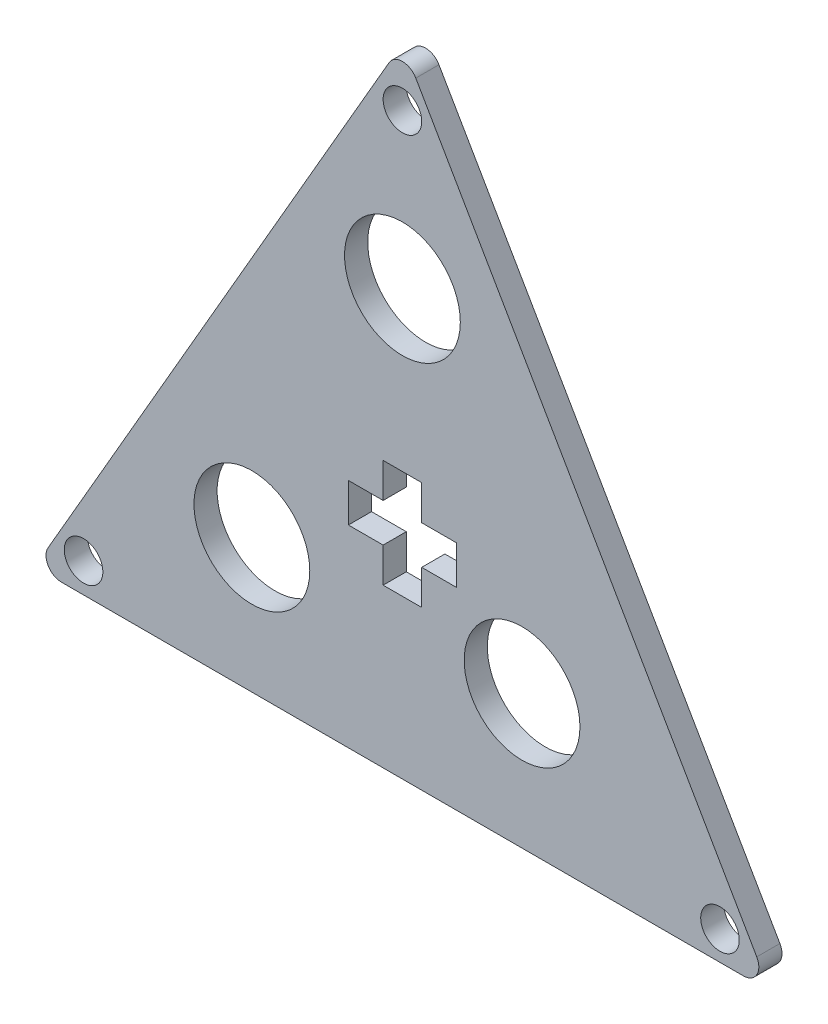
from build123d import *

# Parameters (mm, degrees)
EXTRUDE_1_DEPTH     = 3
FILLET_1_R          = 2
SKETCH_2_R          = 7.5
CUT_EXTRUDE_1_DEPTH = 3
SKETCH_4_R          = 2.5
CUT_EXTRUDE_2_DEPTH = 3
SKETCH_5_R          = 1.5
CUT_EXTRUDE_3_DEPTH = 10
SKETCH_6_W          = 5
SKETCH_6_H          = 14
SKETCH_6_W_2        = 14
SKETCH_6_H_2        = 5
CUT_EXTRUDE_4_DEPTH = 71.352108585


with BuildPart() as part:
    # Sketch 1 → Extrude 1 (new body)
    with BuildSketch(Plane.XY):
        Polygon((0, 55), (-47.631397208, -27.5), (47.631397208, -27.5), align=None)
    extrude(amount=EXTRUDE_1_DEPTH)

    # Fillet 1
    fillet_1_edges = [part.edges().sort_by_distance(p)[0] for p in [
        (47.631397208, -27.5, 1.5),
        (-47.631397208, -27.5, 1.5),
        (0, 55, 1.5),
    ]]
    fillet(fillet_1_edges, radius=FILLET_1_R)

    # Sketch 2 → Cut-Extrude 1 (cut)
    with BuildSketch(Plane.XY.offset(3)):
        with Locations((0, 27.5)):
            Circle(SKETCH_2_R)
        with Locations((-19.502396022, -10.148880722)):
            Circle(SKETCH_2_R)
        with Locations((15.497603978, -10.148880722)):
            Circle(SKETCH_2_R)
    extrude(amount=-CUT_EXTRUDE_1_DEPTH, mode=Mode.SUBTRACT)

    # Sketch 4 → Cut-Extrude 2 (cut)
    with BuildSketch(Plane.XY.offset(3)):
        with Locations((0, 47.5)):
            Circle(SKETCH_4_R)
        with Locations(Location((-41.305224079, -23.671471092, 0), (0, 0, 180))):
            Circle(SKETCH_4_R)
        with Locations(Location((41.13620668, -23.75, 0), (0, 0, 180))):
            Circle(SKETCH_4_R)
    extrude(amount=-CUT_EXTRUDE_2_DEPTH, mode=Mode.SUBTRACT)

    # Sketch 5 → Cut-Extrude 3 (cut)
    with BuildSketch(Plane.XY.offset(3)):
        Circle(SKETCH_5_R)
    extrude(amount=-CUT_EXTRUDE_3_DEPTH, mode=Mode.SUBTRACT)

    # Sketch 6 → Cut-Extrude 4 (cut, through all)
    with BuildSketch(Plane.XY.offset(3)):
        Rectangle(SKETCH_6_W, SKETCH_6_H)
        Rectangle(SKETCH_6_W_2, SKETCH_6_H_2)
    extrude(amount=-CUT_EXTRUDE_4_DEPTH, mode=Mode.SUBTRACT)


solid = part.part
